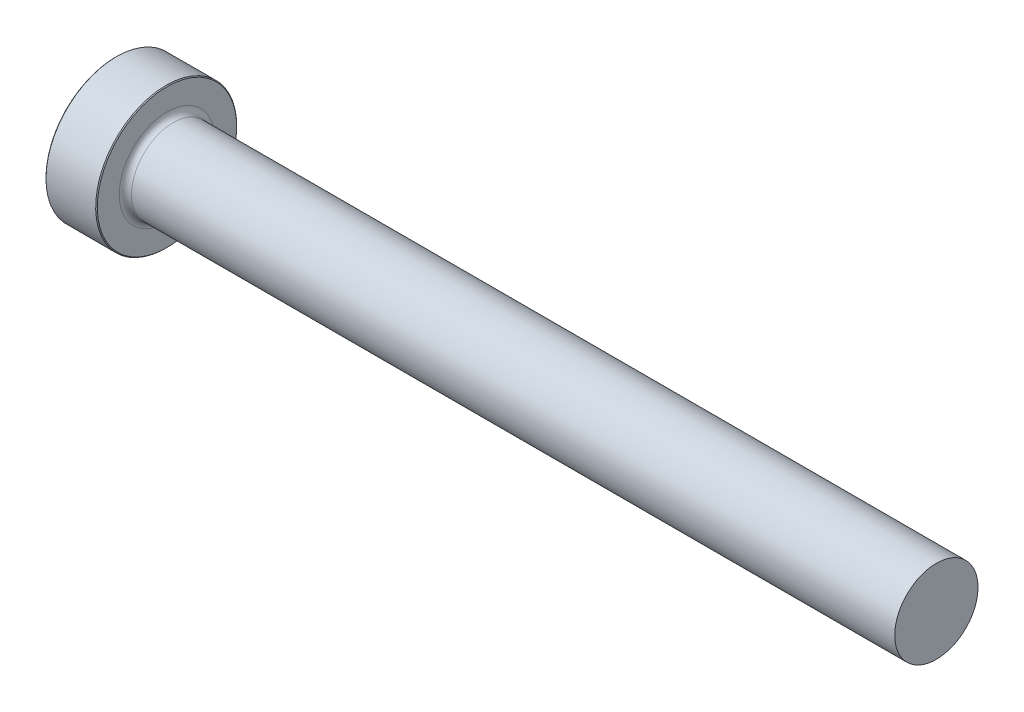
from build123d import *

# Parameters (mm, degrees)
CHAMFER1_SIZE = 0.1016


with BuildPart() as part:
    # Sketch1 → Revolve1 (revolve)
    with BuildSketch(Plane.XY):
        with BuildLine():
            Line((0, 0), (0, 8.73125))
            Line((0, 8.73125), (6.35, 8.73125))
            Line((6.35, 8.73125), (6.35, 5.917565))
            ThreePointArc((6.35, 5.917565), (6.573184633, 5.378749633), (7.112, 5.155565))
            Line((7.112, 5.155565), (101.6, 5.155565))
            Line((101.6, 5.155565), (101.6, 0))
            Line((101.6, 0), (0, 0))
        make_face()
    revolve(axis=Axis((101.6, 0, 0), (-1, 0, 0)))

    # Chamfer1
    chamfer1_edges = [part.edges().sort_by_distance(p)[0] for p in [
        (0, -8.73125, 0),
        (6.35, -8.73125, 0),
    ]]
    chamfer(chamfer1_edges, length=CHAMFER1_SIZE)


solid = part.part
